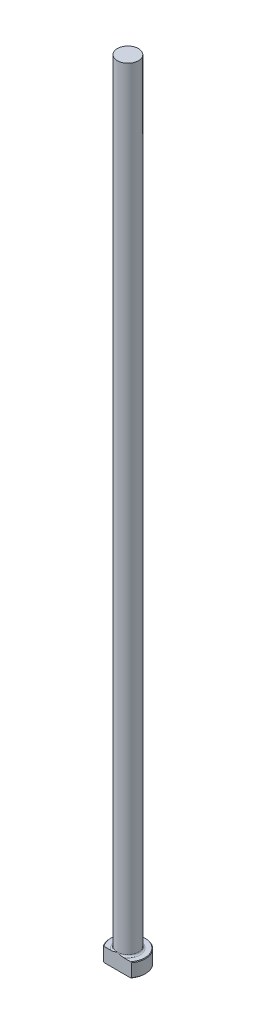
ISO-10303-21;
HEADER;
FILE_DESCRIPTION(('STEP AP214'),'2;1');
FILE_NAME('part.step','',(''),(''),'','','');
FILE_SCHEMA(('AUTOMOTIVE_DESIGN { 1 0 10303 214 1 1 1 1 }'));
ENDSEC;
DATA;
#1=APPLICATION_CONTEXT('core data for automotive mechanical design processes');
#2=APPLICATION_PROTOCOL_DEFINITION('international standard','automotive_design',2000,#1);
#3=PRODUCT_CONTEXT('',#1,'mechanical');
#4=PRODUCT('Part','Part','',(#3));
#5=PRODUCT_RELATED_PRODUCT_CATEGORY('part','',(#4));
#6=PRODUCT_DEFINITION_FORMATION('','',#4);
#7=PRODUCT_DEFINITION_CONTEXT('part definition',#1,'design');
#8=PRODUCT_DEFINITION('design','',#6,#7);
#9=PRODUCT_DEFINITION_SHAPE('','',#8);
#10=(LENGTH_UNIT() NAMED_UNIT(*) SI_UNIT(.MILLI.,.METRE.));
#11=(NAMED_UNIT(*) PLANE_ANGLE_UNIT() SI_UNIT($,.RADIAN.));
#12=(NAMED_UNIT(*) SI_UNIT($,.STERADIAN.) SOLID_ANGLE_UNIT());
#13=UNCERTAINTY_MEASURE_WITH_UNIT(LENGTH_MEASURE(1.E-05),#10,'distance_accuracy_value','');
#14=(GEOMETRIC_REPRESENTATION_CONTEXT(3) GLOBAL_UNCERTAINTY_ASSIGNED_CONTEXT((#13)) GLOBAL_UNIT_ASSIGNED_CONTEXT((#10,
#11,#12)) REPRESENTATION_CONTEXT('',''));
#15=CARTESIAN_POINT('',(0.,0.,0.));
#16=DIRECTION('',(0.,0.,1.));
#17=DIRECTION('',(1.,0.,0.));
#18=AXIS2_PLACEMENT_3D('',#15,#16,#17);
#19=CARTESIAN_POINT('',(0.,0.,0.));
#20=DIRECTION('',(0.,-1.,0.));
#21=DIRECTION('',(0.,0.,-1.));
#22=AXIS2_PLACEMENT_3D('',#19,#20,#21);
#23=PLANE('',#22);
#24=CARTESIAN_POINT('',(0.,0.,0.));
#25=DIRECTION('',(0.,-1.,0.));
#26=DIRECTION('',(0.,0.,-1.));
#27=AXIS2_PLACEMENT_3D('',#24,#25,#26);
#28=CIRCLE('',#27,7.68349999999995);
#29=CARTESIAN_POINT('',(-6.02949135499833,0.,4.76249999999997));
#30=VERTEX_POINT('',#29);
#31=CARTESIAN_POINT('',(6.02949135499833,0.,4.76249999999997));
#32=VERTEX_POINT('',#31);
#33=EDGE_CURVE('E98',#30,#32,#28,.T.);
#34=ORIENTED_EDGE('',*,*,#33,.T.);
#35=DIRECTION('',(-1.,0.,0.));
#36=VECTOR('',#35,1.);
#37=CARTESIAN_POINT('',(-6.34999999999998,0.,4.76249999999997));
#38=LINE('',#37,#36);
#39=EDGE_CURVE('E83',#32,#30,#38,.T.);
#40=ORIENTED_EDGE('',*,*,#39,.T.);
#41=EDGE_LOOP('',(#34,#40));
#42=FACE_BOUND('',#41,.T.);
#43=ADVANCED_FACE('F32',(#42),#23,.T.);
#44=CARTESIAN_POINT('',(0.,259.958771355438,0.));
#45=DIRECTION('',(0.,1.,0.));
#46=DIRECTION('',(0.,0.,1.));
#47=AXIS2_PLACEMENT_3D('',#44,#45,#46);
#48=CYLINDRICAL_SURFACE('',#47,7.93749999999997);
#49=CARTESIAN_POINT('',(0.,6.09599999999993,0.));
#50=DIRECTION('',(0.,1.,0.));
#51=DIRECTION('',(0.,0.,1.));
#52=AXIS2_PLACEMENT_3D('',#49,#50,#51);
#53=CIRCLE('',#52,7.93749999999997);
#54=CARTESIAN_POINT('',(-6.34999999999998,6.09599999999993,4.76249999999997));
#55=VERTEX_POINT('',#54);
#56=CARTESIAN_POINT('',(6.34999999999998,6.09599999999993,4.76249999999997));
#57=VERTEX_POINT('',#56);
#58=EDGE_CURVE('E104',#55,#57,#53,.F.);
#59=ORIENTED_EDGE('',*,*,#58,.T.);
#60=DIRECTION('',(0.,-1.,0.));
#61=VECTOR('',#60,1.);
#62=CARTESIAN_POINT('',(6.34999999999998,355.6,4.76249999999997));
#63=LINE('',#62,#61);
#64=CARTESIAN_POINT('',(6.34999999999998,0.254000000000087,4.76249999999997));
#65=VERTEX_POINT('',#64);
#66=EDGE_CURVE('E183',#57,#65,#63,.T.);
#67=ORIENTED_EDGE('',*,*,#66,.T.);
#68=CARTESIAN_POINT('',(0.,0.254000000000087,0.));
#69=DIRECTION('',(0.,-1.,0.));
#70=DIRECTION('',(0.,0.,-1.));
#71=AXIS2_PLACEMENT_3D('',#68,#69,#70);
#72=CIRCLE('',#71,7.93749999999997);
#73=CARTESIAN_POINT('',(-6.34999999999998,0.254000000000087,4.76249999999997));
#74=VERTEX_POINT('',#73);
#75=EDGE_CURVE('E100',#65,#74,#72,.F.);
#76=ORIENTED_EDGE('',*,*,#75,.T.);
#77=DIRECTION('',(0.,-1.,0.));
#78=VECTOR('',#77,1.);
#79=CARTESIAN_POINT('',(-6.34999999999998,355.6,4.76249999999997));
#80=LINE('',#79,#78);
#81=EDGE_CURVE('E93',#55,#74,#80,.T.);
#82=ORIENTED_EDGE('',*,*,#81,.F.);
#83=EDGE_LOOP('',(#59,#67,#76,#82));
#84=FACE_BOUND('',#83,.T.);
#85=ADVANCED_FACE('F158',(#84),#48,.T.);
#86=CARTESIAN_POINT('',(-7.93749999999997,6.35,0.));
#87=DIRECTION('',(0.,1.,0.));
#88=DIRECTION('',(0.,0.,1.));
#89=AXIS2_PLACEMENT_3D('',#86,#87,#88);
#90=PLANE('',#89);
#91=CARTESIAN_POINT('',(0.,6.35,0.));
#92=DIRECTION('',(0.,1.,0.));
#93=DIRECTION('',(0.,0.,1.));
#94=AXIS2_PLACEMENT_3D('',#91,#92,#93);
#95=CIRCLE('',#94,7.68349999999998);
#96=CARTESIAN_POINT('',(6.02949135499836,6.35,4.76249999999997));
#97=VERTEX_POINT('',#96);
#98=CARTESIAN_POINT('',(-6.02949135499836,6.35,4.76249999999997));
#99=VERTEX_POINT('',#98);
#100=EDGE_CURVE('E178',#97,#99,#95,.T.);
#101=ORIENTED_EDGE('',*,*,#100,.T.);
#102=DIRECTION('',(1.,0.,0.));
#103=VECTOR('',#102,1.);
#104=CARTESIAN_POINT('',(-7.93749999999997,6.35,4.76249999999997));
#105=LINE('',#104,#103);
#106=CARTESIAN_POINT('',(-2.79976677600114,6.35000000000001,4.76249999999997));
#107=VERTEX_POINT('',#106);
#108=EDGE_CURVE('E57',#99,#107,#105,.T.);
#109=ORIENTED_EDGE('',*,*,#108,.T.);
#110=CARTESIAN_POINT('',(0.,6.35,0.));
#111=DIRECTION('',(0.,1.,0.));
#112=DIRECTION('',(0.,0.,1.));
#113=AXIS2_PLACEMENT_3D('',#110,#111,#112);
#114=CIRCLE('',#113,5.52449999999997);
#115=CARTESIAN_POINT('',(2.79976677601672,6.35000000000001,4.76249999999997));
#116=VERTEX_POINT('',#115);
#117=EDGE_CURVE('E107',#107,#116,#114,.F.);
#118=ORIENTED_EDGE('',*,*,#117,.T.);
#119=EDGE_CURVE('E136',#116,#97,#105,.T.);
#120=ORIENTED_EDGE('',*,*,#119,.T.);
#121=EDGE_LOOP('',(#101,#109,#118,#120));
#122=FACE_BOUND('',#121,.T.);
#123=ADVANCED_FACE('F147',(#122),#90,.T.);
#124=CARTESIAN_POINT('',(0.,6.35000000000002,0.));
#125=DIRECTION('',(0.,-1.,0.));
#126=DIRECTION('',(0.,0.,-1.));
#127=AXIS2_PLACEMENT_3D('',#124,#125,#126);
#128=CONICAL_SURFACE('',#127,7.68349999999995,0.785398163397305);
#129=ORIENTED_EDGE('',*,*,#58,.F.);
#130=CARTESIAN_POINT('',(-13.9717238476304,-0.727613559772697,4.76249999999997));
#131=CARTESIAN_POINT('',(-13.7440124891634,-0.512084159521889,4.76249999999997));
#132=CARTESIAN_POINT('',(-13.5160318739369,-0.29683895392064,4.76249999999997));
#133=CARTESIAN_POINT('',(-13.0594385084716,0.13298258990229,4.76249999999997));
#134=CARTESIAN_POINT('',(-12.8308257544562,0.347558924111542,4.76249999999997));
#135=CARTESIAN_POINT('',(-12.1433698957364,0.99062866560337,4.76249999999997));
#136=CARTESIAN_POINT('',(-11.6834388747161,1.41796058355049,4.76249999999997));
#137=CARTESIAN_POINT('',(-10.7398192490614,2.28660831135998,4.76249999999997));
#138=CARTESIAN_POINT('',(-10.2559580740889,2.72773732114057,4.76249999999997));
#139=CARTESIAN_POINT('',(-9.52579613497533,3.38404130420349,4.76249999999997));
#140=CARTESIAN_POINT('',(-9.28181372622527,3.60179461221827,4.76249999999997));
#141=CARTESIAN_POINT('',(-8.7919558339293,4.03515959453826,4.76249999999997));
#142=CARTESIAN_POINT('',(-8.54608036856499,4.25077128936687,4.76249999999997));
#143=CARTESIAN_POINT('',(-8.0523506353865,4.67899963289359,4.76249999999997));
#144=CARTESIAN_POINT('',(-7.80449972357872,4.89162014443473,4.76249999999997));
#145=CARTESIAN_POINT('',(-7.30587283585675,5.3134375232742,4.76249999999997));
#146=CARTESIAN_POINT('',(-7.05509670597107,5.52263420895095,4.76249999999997));
#147=CARTESIAN_POINT('',(-6.54895570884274,5.93726289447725,4.76249999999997));
#148=CARTESIAN_POINT('',(-6.29357776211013,6.14267898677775,4.76249999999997));
#149=CARTESIAN_POINT('',(-5.77806261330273,6.54738613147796,4.76249999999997));
#150=CARTESIAN_POINT('',(-5.5179261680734,6.74667814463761,4.76249999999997));
#151=CARTESIAN_POINT('',(-4.99669315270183,7.13290361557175,4.76249999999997));
#152=CARTESIAN_POINT('',(-4.73572280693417,7.32000565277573,4.76249999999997));
#153=CARTESIAN_POINT('',(-4.33820944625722,7.59205599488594,4.76249999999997));
#154=CARTESIAN_POINT('',(-4.20463607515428,7.68134253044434,4.76249999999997));
#155=CARTESIAN_POINT('',(-3.93520014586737,7.85638938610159,4.76249999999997));
#156=CARTESIAN_POINT('',(-3.79933771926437,7.9421499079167,4.76249999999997));
#157=CARTESIAN_POINT('',(-3.52582078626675,8.10887856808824,4.76249999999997));
#158=CARTESIAN_POINT('',(-3.38818211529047,8.18987258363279,4.76249999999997));
#159=CARTESIAN_POINT('',(-3.10994368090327,8.34667799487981,4.76249999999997));
#160=CARTESIAN_POINT('',(-2.96934354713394,8.42248873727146,4.76249999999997));
#161=CARTESIAN_POINT('',(-2.68509318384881,8.56758570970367,4.76249999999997));
#162=CARTESIAN_POINT('',(-2.5414484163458,8.63688258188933,4.76249999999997));
#163=CARTESIAN_POINT('',(-2.25062082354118,8.76758710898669,4.76249999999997));
#164=CARTESIAN_POINT('',(-2.10343915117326,8.82899729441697,4.76249999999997));
#165=CARTESIAN_POINT('',(-1.88433335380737,8.91218004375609,4.76249999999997));
#166=CARTESIAN_POINT('',(-1.81383186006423,8.9377212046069,4.76249999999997));
#167=CARTESIAN_POINT('',(-1.67202052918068,8.98645907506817,4.76249999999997));
#168=CARTESIAN_POINT('',(-1.6007106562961,9.00965568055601,4.76249999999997));
#169=CARTESIAN_POINT('',(-1.38555472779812,9.0754228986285,4.76249999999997));
#170=CARTESIAN_POINT('',(-1.24050522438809,9.11416209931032,4.76249999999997));
#171=CARTESIAN_POINT('',(-0.948515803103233,9.1795356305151,4.76249999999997));
#172=CARTESIAN_POINT('',(-0.801590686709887,9.20623542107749,4.76249999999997));
#173=CARTESIAN_POINT('',(-0.50593058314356,9.24644001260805,4.76249999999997));
#174=CARTESIAN_POINT('',(-0.357195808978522,9.25994635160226,4.76249999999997));
#175=CARTESIAN_POINT('',(-0.0580773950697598,9.2730054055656,4.76249999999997));
#176=CARTESIAN_POINT('',(0.0923105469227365,9.27246142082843,4.76249999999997));
#177=CARTESIAN_POINT('',(0.392354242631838,9.25721584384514,4.76249999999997));
#178=CARTESIAN_POINT('',(0.5420099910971,9.24251415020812,4.76249999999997));
#179=CARTESIAN_POINT('',(0.840076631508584,9.19973713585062,4.76249999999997));
#180=CARTESIAN_POINT('',(0.988478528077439,9.17160009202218,4.76249999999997));
#181=CARTESIAN_POINT('',(1.28250292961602,9.10341431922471,4.76249999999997));
#182=CARTESIAN_POINT('',(1.42812484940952,9.0633631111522,4.76249999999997));
#183=CARTESIAN_POINT('',(1.8015765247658,8.946301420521,4.76249999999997));
#184=CARTESIAN_POINT('',(2.02694427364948,8.86145845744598,4.76249999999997));
#185=CARTESIAN_POINT('',(2.46947102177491,8.67257542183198,4.76249999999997));
#186=CARTESIAN_POINT('',(2.6866230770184,8.56851952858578,4.76249999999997));
#187=CARTESIAN_POINT('',(3.00782565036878,8.40144847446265,4.76249999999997));
#188=CARTESIAN_POINT('',(3.11463323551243,8.34362692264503,4.76249999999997));
#189=CARTESIAN_POINT('',(3.32653927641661,8.22492412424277,4.76249999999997));
#190=CARTESIAN_POINT('',(3.43163771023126,8.16404283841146,4.76249999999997));
#191=CARTESIAN_POINT('',(3.64022442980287,8.03970047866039,4.76249999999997));
#192=CARTESIAN_POINT('',(3.74371344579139,7.97624062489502,4.76249999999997));
#193=CARTESIAN_POINT('',(3.94927417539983,7.84708004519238,4.76249999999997));
#194=CARTESIAN_POINT('',(4.05134594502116,7.78137940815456,4.76249999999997));
#195=CARTESIAN_POINT('',(4.39010681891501,7.55875403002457,4.76249999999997));
#196=CARTESIAN_POINT('',(4.62396840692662,7.39752115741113,4.76249999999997));
#197=CARTESIAN_POINT('',(5.08629215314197,7.06746483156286,4.76249999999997));
#198=CARTESIAN_POINT('',(5.31475310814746,6.89863971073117,4.76249999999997));
#199=CARTESIAN_POINT('',(5.76756292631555,6.55523763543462,4.76249999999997));
#200=CARTESIAN_POINT('',(5.99190862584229,6.38065652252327,4.76249999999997));
#201=CARTESIAN_POINT('',(6.43717517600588,6.02723273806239,4.76249999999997));
#202=CARTESIAN_POINT('',(6.65809630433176,5.84839041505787,4.76249999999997));
#203=CARTESIAN_POINT('',(7.09790647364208,5.48680641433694,4.76249999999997));
#204=CARTESIAN_POINT('',(7.31678672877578,5.30405407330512,4.76249999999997));
#205=CARTESIAN_POINT('',(7.75231370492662,4.93590430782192,4.76249999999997));
#206=CARTESIAN_POINT('',(7.9689603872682,4.75050683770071,4.76249999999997));
#207=CARTESIAN_POINT('',(8.4003252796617,4.37766695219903,4.76249999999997));
#208=CARTESIAN_POINT('',(8.6150442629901,4.19022543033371,4.76249999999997));
#209=CARTESIAN_POINT('',(9.04295707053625,3.81360841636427,4.76249999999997));
#210=CARTESIAN_POINT('',(9.25615088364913,3.62443291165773,4.76249999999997));
#211=CARTESIAN_POINT('',(9.85099823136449,3.09302727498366,4.76249999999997));
#212=CARTESIAN_POINT('',(10.2312296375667,2.74920552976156,4.76249999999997));
#213=CARTESIAN_POINT('',(10.9886755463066,2.05817278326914,4.76249999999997));
#214=CARTESIAN_POINT('',(11.3658896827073,1.71096138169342,4.76249999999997));
#215=CARTESIAN_POINT('',(12.1155837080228,1.01624347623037,4.76249999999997));
#216=CARTESIAN_POINT('',(12.4880784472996,0.668752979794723,4.76249999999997));
#217=CARTESIAN_POINT('',(13.2311819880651,-0.0281268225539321,4.76249999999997));
#218=CARTESIAN_POINT('',(13.601791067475,-0.377515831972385,4.76249999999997));
#219=CARTESIAN_POINT('',(13.9717238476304,-0.727613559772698,4.76249999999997));
#220=B_SPLINE_CURVE_WITH_KNOTS('',3,(#130,#131,#132,#133,#134,#135,#136,#137,#138,#139,#140,
#141,#142,#143,#144,#145,#146,#147,#148,#149,#150,#151,#152,#153,#154,#155,#156,#157,#158,#159,
#160,#161,#162,#163,#164,#165,#166,#167,#168,#169,#170,#171,#172,#173,#174,#175,#176,#177,#178,
#179,#180,#181,#182,#183,#184,#185,#186,#187,#188,#189,#190,#191,#192,#193,#194,#195,#196,#197,
#198,#199,#200,#201,#202,#203,#204,#205,#206,#207,#208,#209,#210,#211,#212,#213,#214,#215,#216,
#217,#218,#219),.UNSPECIFIED.,.F.,.F.,(4,2,2,2,2,2,2,2,2,2,2,2,2,2,2,2,2,2,2,2,2,2,2,2,2,2,2,2,
2,2,2,2,2,2,2,2,2,2,2,2,2,2,2,2,4),(0.,0.940610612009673,1.88122685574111,3.76464908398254,
5.72889030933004,6.7099492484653,7.69099877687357,8.67063680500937,9.650326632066,
10.6334769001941,11.6164721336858,12.5795523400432,13.0615108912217,13.543441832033,
14.022454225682,14.5015268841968,14.9798027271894,15.457924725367,15.682844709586,
15.9077746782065,16.3577079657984,16.8051644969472,17.2525688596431,17.7030532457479,
18.1535408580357,18.606118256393,19.0587898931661,19.7799130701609,20.5016327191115,
20.86595589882,21.2302837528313,21.5944411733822,21.958584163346,22.8105074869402,
23.6626188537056,24.515359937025,25.3680315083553,26.2234368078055,27.0788568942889,
27.9339169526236,28.7889832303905,30.3268416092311,31.8648838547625,33.393116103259,
34.9211161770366),.UNSPECIFIED.);
#221=EDGE_CURVE('E135',#55,#99,#220,.T.);
#222=ORIENTED_EDGE('',*,*,#221,.T.);
#223=ORIENTED_EDGE('',*,*,#100,.F.);
#224=EDGE_CURVE('E127',#97,#57,#220,.T.);
#225=ORIENTED_EDGE('',*,*,#224,.T.);
#226=EDGE_LOOP('',(#129,#222,#223,#225));
#227=FACE_BOUND('',#226,.T.);
#228=ADVANCED_FACE('F143',(#227),#128,.T.);
#229=CARTESIAN_POINT('',(0.,0.254000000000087,0.));
#230=DIRECTION('',(0.,1.,0.));
#231=DIRECTION('',(0.,0.,1.));
#232=AXIS2_PLACEMENT_3D('',#229,#230,#231);
#233=CONICAL_SURFACE('',#232,7.93749999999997,0.785398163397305);
#234=ORIENTED_EDGE('',*,*,#75,.F.);
#235=CARTESIAN_POINT('',(13.9717238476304,7.07761355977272,4.76249999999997));
#236=CARTESIAN_POINT('',(13.7440124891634,6.86208415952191,4.76249999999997));
#237=CARTESIAN_POINT('',(13.5160318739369,6.64683895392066,4.76249999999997));
#238=CARTESIAN_POINT('',(13.0594385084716,6.21701741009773,4.76249999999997));
#239=CARTESIAN_POINT('',(12.8308257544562,6.00244107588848,4.76249999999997));
#240=CARTESIAN_POINT('',(12.1433698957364,5.35937133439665,4.76249999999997));
#241=CARTESIAN_POINT('',(11.6834388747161,4.93203941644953,4.76249999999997));
#242=CARTESIAN_POINT('',(10.7398192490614,4.06339168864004,4.76249999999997));
#243=CARTESIAN_POINT('',(10.2559580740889,3.62226267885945,4.76249999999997));
#244=CARTESIAN_POINT('',(9.52579613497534,2.96595869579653,4.76249999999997));
#245=CARTESIAN_POINT('',(9.28181372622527,2.74820538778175,4.76249999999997));
#246=CARTESIAN_POINT('',(8.7919558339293,2.31484040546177,4.76249999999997));
#247=CARTESIAN_POINT('',(8.546080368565,2.09922871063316,4.76249999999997));
#248=CARTESIAN_POINT('',(8.0523506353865,1.67100036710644,4.76249999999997));
#249=CARTESIAN_POINT('',(7.80449972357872,1.4583798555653,4.76249999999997));
#250=CARTESIAN_POINT('',(7.30587283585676,1.03656247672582,4.76249999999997));
#251=CARTESIAN_POINT('',(7.05509670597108,0.827365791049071,4.76249999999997));
#252=CARTESIAN_POINT('',(6.54895570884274,0.412737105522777,4.76249999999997));
#253=CARTESIAN_POINT('',(6.29357776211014,0.207321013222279,4.76249999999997));
#254=CARTESIAN_POINT('',(5.77806261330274,-0.197386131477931,4.76249999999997));
#255=CARTESIAN_POINT('',(5.5179261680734,-0.396678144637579,4.76249999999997));
#256=CARTESIAN_POINT('',(4.99669315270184,-0.782903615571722,4.76249999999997));
#257=CARTESIAN_POINT('',(4.73572280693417,-0.970005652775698,4.76249999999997));
#258=CARTESIAN_POINT('',(4.33820944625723,-1.24205599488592,4.76249999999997));
#259=CARTESIAN_POINT('',(4.20463607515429,-1.33134253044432,4.76249999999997));
#260=CARTESIAN_POINT('',(3.93520014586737,-1.50638938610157,4.76249999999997));
#261=CARTESIAN_POINT('',(3.79933771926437,-1.59214990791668,4.76249999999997));
#262=CARTESIAN_POINT('',(3.52582078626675,-1.75887856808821,4.76249999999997));
#263=CARTESIAN_POINT('',(3.38818211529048,-1.83987258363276,4.76249999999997));
#264=CARTESIAN_POINT('',(3.10994368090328,-1.99667799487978,4.76249999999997));
#265=CARTESIAN_POINT('',(2.96934354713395,-2.07248873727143,4.76249999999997));
#266=CARTESIAN_POINT('',(2.68509318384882,-2.21758570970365,4.76249999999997));
#267=CARTESIAN_POINT('',(2.54144841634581,-2.2868825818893,4.76249999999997));
#268=CARTESIAN_POINT('',(2.25062082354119,-2.41758710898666,4.76249999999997));
#269=CARTESIAN_POINT('',(2.10343915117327,-2.47899729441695,4.76249999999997));
#270=CARTESIAN_POINT('',(1.88433335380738,-2.56218004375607,4.76249999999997));
#271=CARTESIAN_POINT('',(1.81383186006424,-2.58772120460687,4.76249999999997));
#272=CARTESIAN_POINT('',(1.67202052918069,-2.63645907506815,4.76249999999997));
#273=CARTESIAN_POINT('',(1.60071065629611,-2.65965568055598,4.76249999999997));
#274=CARTESIAN_POINT('',(1.38555472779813,-2.72542289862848,4.76249999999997));
#275=CARTESIAN_POINT('',(1.2405052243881,-2.7641620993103,4.76249999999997));
#276=CARTESIAN_POINT('',(0.948515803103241,-2.82953563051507,4.76249999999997));
#277=CARTESIAN_POINT('',(0.801590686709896,-2.85623542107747,4.76249999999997));
#278=CARTESIAN_POINT('',(0.505930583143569,-2.89644001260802,4.76249999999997));
#279=CARTESIAN_POINT('',(0.357195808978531,-2.90994635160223,4.76249999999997));
#280=CARTESIAN_POINT('',(0.0580773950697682,-2.92300540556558,4.76249999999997));
#281=CARTESIAN_POINT('',(-0.0923105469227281,-2.92246142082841,4.76249999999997));
#282=CARTESIAN_POINT('',(-0.392354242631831,-2.90721584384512,4.76249999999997));
#283=CARTESIAN_POINT('',(-0.542009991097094,-2.8925141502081,4.76249999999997));
#284=CARTESIAN_POINT('',(-0.840076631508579,-2.84973713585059,4.76249999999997));
#285=CARTESIAN_POINT('',(-0.988478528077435,-2.82160009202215,4.76249999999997));
#286=CARTESIAN_POINT('',(-1.28250292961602,-2.75341431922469,4.76249999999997));
#287=CARTESIAN_POINT('',(-1.42812484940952,-2.71336311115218,4.76249999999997));
#288=CARTESIAN_POINT('',(-1.80157652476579,-2.59630142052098,4.76249999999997));
#289=CARTESIAN_POINT('',(-2.02694427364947,-2.51145845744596,4.76249999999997));
#290=CARTESIAN_POINT('',(-2.4694710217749,-2.32257542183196,4.76249999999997));
#291=CARTESIAN_POINT('',(-2.68662307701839,-2.21851952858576,4.76249999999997));
#292=CARTESIAN_POINT('',(-3.00782565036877,-2.05144847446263,4.76249999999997));
#293=CARTESIAN_POINT('',(-3.11463323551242,-1.99362692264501,4.76249999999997));
#294=CARTESIAN_POINT('',(-3.3265392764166,-1.87492412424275,4.76249999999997));
#295=CARTESIAN_POINT('',(-3.43163771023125,-1.81404283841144,4.76249999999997));
#296=CARTESIAN_POINT('',(-3.64022442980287,-1.68970047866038,4.76249999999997));
#297=CARTESIAN_POINT('',(-3.74371344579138,-1.626240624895,4.76249999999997));
#298=CARTESIAN_POINT('',(-3.94927417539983,-1.49708004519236,4.76249999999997));
#299=CARTESIAN_POINT('',(-4.05134594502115,-1.43137940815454,4.76249999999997));
#300=CARTESIAN_POINT('',(-4.390106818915,-1.20875403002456,4.76249999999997));
#301=CARTESIAN_POINT('',(-4.62396840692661,-1.04752115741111,4.76249999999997));
#302=CARTESIAN_POINT('',(-5.08629215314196,-0.71746483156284,4.76249999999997));
#303=CARTESIAN_POINT('',(-5.31475310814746,-0.548639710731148,4.76249999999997));
#304=CARTESIAN_POINT('',(-5.76756292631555,-0.205237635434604,4.76249999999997));
#305=CARTESIAN_POINT('',(-5.99190862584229,-0.0306565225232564,4.76249999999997));
#306=CARTESIAN_POINT('',(-6.43717517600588,0.322767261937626,4.76249999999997));
#307=CARTESIAN_POINT('',(-6.65809630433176,0.501609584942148,4.76249999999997));
#308=CARTESIAN_POINT('',(-7.09790647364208,0.863193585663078,4.76249999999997));
#309=CARTESIAN_POINT('',(-7.31678672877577,1.0459459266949,4.76249999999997));
#310=CARTESIAN_POINT('',(-7.75231370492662,1.4140956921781,4.76249999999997));
#311=CARTESIAN_POINT('',(-7.96896038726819,1.59949316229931,4.76249999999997));
#312=CARTESIAN_POINT('',(-8.4003252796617,1.97233304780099,4.76249999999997));
#313=CARTESIAN_POINT('',(-8.61504426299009,2.15977456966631,4.76249999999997));
#314=CARTESIAN_POINT('',(-9.04295707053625,2.53639158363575,4.76249999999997));
#315=CARTESIAN_POINT('',(-9.25615088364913,2.72556708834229,4.76249999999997));
#316=CARTESIAN_POINT('',(-9.85099823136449,3.25697272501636,4.76249999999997));
#317=CARTESIAN_POINT('',(-10.2312296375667,3.60079447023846,4.76249999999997));
#318=CARTESIAN_POINT('',(-10.9886755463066,4.29182721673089,4.76249999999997));
#319=CARTESIAN_POINT('',(-11.3658896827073,4.63903861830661,4.76249999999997));
#320=CARTESIAN_POINT('',(-12.1155837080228,5.33375652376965,4.76249999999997));
#321=CARTESIAN_POINT('',(-12.4880784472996,5.6812470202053,4.76249999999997));
#322=CARTESIAN_POINT('',(-13.2311819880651,6.37812682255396,4.76249999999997));
#323=CARTESIAN_POINT('',(-13.601791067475,6.72751583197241,4.76249999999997));
#324=CARTESIAN_POINT('',(-13.9717238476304,7.07761355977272,4.76249999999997));
#325=B_SPLINE_CURVE_WITH_KNOTS('',3,(#235,#236,#237,#238,#239,#240,#241,#242,#243,#244,#245,
#246,#247,#248,#249,#250,#251,#252,#253,#254,#255,#256,#257,#258,#259,#260,#261,#262,#263,#264,
#265,#266,#267,#268,#269,#270,#271,#272,#273,#274,#275,#276,#277,#278,#279,#280,#281,#282,#283,
#284,#285,#286,#287,#288,#289,#290,#291,#292,#293,#294,#295,#296,#297,#298,#299,#300,#301,#302,
#303,#304,#305,#306,#307,#308,#309,#310,#311,#312,#313,#314,#315,#316,#317,#318,#319,#320,#321,
#322,#323,#324),.UNSPECIFIED.,.F.,.F.,(4,2,2,2,2,2,2,2,2,2,2,2,2,2,2,2,2,2,2,2,2,2,2,2,2,2,2,2,
2,2,2,2,2,2,2,2,2,2,2,2,2,2,2,2,4),(0.,0.940610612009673,1.88122685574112,3.76464908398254,
5.72889030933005,6.7099492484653,7.69099877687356,8.67063680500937,9.650326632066,
10.6334769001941,11.6164721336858,12.5795523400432,13.0615108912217,13.543441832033,
14.022454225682,14.5015268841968,14.9798027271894,15.4579247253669,15.682844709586,
15.9077746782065,16.3577079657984,16.8051644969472,17.2525688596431,17.7030532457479,
18.1535408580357,18.606118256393,19.0587898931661,19.7799130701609,20.5016327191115,
20.86595589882,21.2302837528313,21.5944411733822,21.958584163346,22.8105074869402,
23.6626188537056,24.515359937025,25.3680315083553,26.2234368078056,27.0788568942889,
27.9339169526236,28.7889832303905,30.3268416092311,31.8648838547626,33.393116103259,
34.9211161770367),.UNSPECIFIED.);
#326=EDGE_CURVE('E86',#65,#32,#325,.T.);
#327=ORIENTED_EDGE('',*,*,#326,.T.);
#328=ORIENTED_EDGE('',*,*,#33,.F.);
#329=EDGE_CURVE('E89',#30,#74,#325,.T.);
#330=ORIENTED_EDGE('',*,*,#329,.T.);
#331=EDGE_LOOP('',(#234,#327,#328,#330));
#332=FACE_BOUND('',#331,.T.);
#333=ADVANCED_FACE('F97',(#332),#233,.T.);
#334=CARTESIAN_POINT('',(0.,7.11200000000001,0.));
#335=DIRECTION('',(0.,1.,0.));
#336=DIRECTION('',(0.,0.,1.));
#337=AXIS2_PLACEMENT_3D('',#334,#335,#336);
#338=TOROIDAL_SURFACE('',#337,5.52449999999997,0.762);
#339=CARTESIAN_POINT('',(0.,7.11200000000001,4.76249999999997));
#340=CARTESIAN_POINT('',(1.7571576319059E-10,7.11200099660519,4.76249999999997));
#341=CARTESIAN_POINT('',(2.11716127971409E-07,7.11200199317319,4.76249999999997));
#342=CARTESIAN_POINT('',(8.80753956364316E-07,7.1120039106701,4.76249999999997));
#343=CARTESIAN_POINT('',(1.34491796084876E-06,7.11200482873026,4.76249999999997));
#344=CARTESIAN_POINT('',(2.45982947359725E-06,7.11200666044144,4.76249999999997));
#345=CARTESIAN_POINT('',(3.12384157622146E-06,7.11200756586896,4.76249999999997));
#346=CARTESIAN_POINT('',(4.5550794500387E-06,7.11200927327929,4.76249999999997));
#347=CARTESIAN_POINT('',(5.32136303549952E-06,7.11201007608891,4.76249999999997));
#348=CARTESIAN_POINT('',(8.07192927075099E-06,7.11201277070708,4.76249999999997));
#349=CARTESIAN_POINT('',(1.01901643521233E-05,7.11201452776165,4.76249999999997));
#350=CARTESIAN_POINT('',(1.4565159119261E-05,7.11201765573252,4.76249999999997));
#351=CARTESIAN_POINT('',(1.68139275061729E-05,7.11201903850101,4.76249999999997));
#352=CARTESIAN_POINT('',(2.56002968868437E-05,7.1120242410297,4.76249999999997));
#353=CARTESIAN_POINT('',(3.23057719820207E-05,7.11202779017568,4.76249999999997));
#354=CARTESIAN_POINT('',(4.55210144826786E-05,7.11203358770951,4.76249999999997));
#355=CARTESIAN_POINT('',(5.19929180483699E-05,7.1120359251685,4.76249999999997));
#356=CARTESIAN_POINT('',(7.95921607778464E-05,7.11204586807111,4.76249999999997));
#357=CARTESIAN_POINT('',(0.000100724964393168,7.11205341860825,4.76249999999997));
#358=CARTESIAN_POINT('',(0.00014026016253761,7.11206552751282,4.76249999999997));
#359=CARTESIAN_POINT('',(0.000158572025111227,7.11207036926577,4.76249999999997));
#360=CARTESIAN_POINT('',(0.000291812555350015,7.11210874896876,4.76249999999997));
#361=CARTESIAN_POINT('',(0.000401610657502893,7.11215771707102,4.76249999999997));
#362=CARTESIAN_POINT('',(0.0008287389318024,7.1123412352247,4.76249999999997));
#363=CARTESIAN_POINT('',(0.00114963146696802,7.11246431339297,4.76249999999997));
#364=CARTESIAN_POINT('',(0.00239628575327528,7.11294956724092,4.76249999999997));
#365=CARTESIAN_POINT('',(0.00331839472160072,7.11332376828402,4.76249999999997));
#366=CARTESIAN_POINT('',(0.00709602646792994,7.11484953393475,4.76249999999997));
#367=CARTESIAN_POINT('',(0.00995556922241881,7.11598757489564,4.76249999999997));
#368=CARTESIAN_POINT('',(0.0776380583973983,7.14293320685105,4.76249999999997));
#369=CARTESIAN_POINT('',(0.142407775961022,7.16892226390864,4.76249999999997));
#370=CARTESIAN_POINT('',(0.269647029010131,7.2196189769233,4.76249999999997));
#371=CARTESIAN_POINT('',(0.332112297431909,7.24433828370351,4.76249999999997));
#372=CARTESIAN_POINT('',(0.464537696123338,7.29630170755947,4.76249999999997));
#373=CARTESIAN_POINT('',(0.534515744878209,7.32350106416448,4.76249999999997));
#374=CARTESIAN_POINT('',(0.67548014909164,7.3774238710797,4.76249999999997));
#375=CARTESIAN_POINT('',(0.746469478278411,7.40413956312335,4.76249999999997));
#376=CARTESIAN_POINT('',(0.870073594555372,7.44962494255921,4.76249999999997));
#377=CARTESIAN_POINT('',(0.922600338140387,7.46863321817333,4.76249999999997));
#378=CARTESIAN_POINT('',(1.02776923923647,7.50591527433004,4.76249999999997));
#379=CARTESIAN_POINT('',(1.08041080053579,7.52419073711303,4.76249999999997));
#380=CARTESIAN_POINT('',(1.23635883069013,7.5769919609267,4.76249999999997));
#381=CARTESIAN_POINT('',(1.34005657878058,7.61037532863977,4.76249999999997));
#382=CARTESIAN_POINT('',(1.56359060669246,7.67746997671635,4.76249999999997));
#383=CARTESIAN_POINT('',(1.68362015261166,7.71054957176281,4.76249999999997));
#384=CARTESIAN_POINT('',(1.92642555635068,7.76967498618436,4.76249999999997));
#385=CARTESIAN_POINT('',(2.04921557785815,7.79566353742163,4.76249999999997));
#386=CARTESIAN_POINT('',(2.30422797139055,7.83918726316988,4.76249999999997));
#387=CARTESIAN_POINT('',(2.43656426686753,7.85610069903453,4.76249999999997));
#388=CARTESIAN_POINT('',(2.63563546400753,7.8702758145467,4.76249999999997));
#389=CARTESIAN_POINT('',(2.70197039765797,7.87313972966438,4.76249999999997));
#390=CARTESIAN_POINT('',(2.83467605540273,7.87452977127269,4.76249999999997));
#391=CARTESIAN_POINT('',(2.90104677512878,7.87305634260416,4.76249999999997));
#392=CARTESIAN_POINT('',(3.06624711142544,7.86305254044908,4.76249999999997));
#393=CARTESIAN_POINT('',(3.1649502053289,7.85140164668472,4.76249999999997));
#394=CARTESIAN_POINT('',(3.3102514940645,7.82310986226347,4.76249999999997));
#395=CARTESIAN_POINT('',(3.35793795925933,7.81197880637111,4.76249999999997));
#396=CARTESIAN_POINT('',(3.45215770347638,7.78564548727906,4.76249999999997));
#397=CARTESIAN_POINT('',(3.49869187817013,7.77044650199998,4.76249999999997));
#398=CARTESIAN_POINT('',(3.59306902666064,7.73421407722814,4.76249999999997));
#399=CARTESIAN_POINT('',(3.64079022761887,7.71285751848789,4.76249999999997));
#400=CARTESIAN_POINT('',(3.73313951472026,7.66398014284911,4.76249999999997));
#401=CARTESIAN_POINT('',(3.77776331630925,7.63645100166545,4.76249999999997));
#402=CARTESIAN_POINT('',(3.8538778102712,7.58041326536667,4.76249999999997));
#403=CARTESIAN_POINT('',(3.88624519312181,7.55310714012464,4.76249999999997));
#404=CARTESIAN_POINT('',(3.94622799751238,7.49369496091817,4.76249999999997));
#405=CARTESIAN_POINT('',(3.97385320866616,7.46159905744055,4.76249999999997));
#406=CARTESIAN_POINT('',(4.01655184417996,7.4011650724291,4.76249999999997));
#407=CARTESIAN_POINT('',(4.03304226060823,7.37383278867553,4.76249999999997));
#408=CARTESIAN_POINT('',(4.06135260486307,7.31682811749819,4.76249999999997));
#409=CARTESIAN_POINT('',(4.07317539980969,7.28715718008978,4.76249999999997));
#410=CARTESIAN_POINT('',(4.09136459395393,7.22592510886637,4.76249999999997));
#411=CARTESIAN_POINT('',(4.09769076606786,7.19435181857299,4.76249999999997));
#412=CARTESIAN_POINT('',(4.10417375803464,7.13057793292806,4.76249999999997));
#413=CARTESIAN_POINT('',(4.10433369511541,7.0983776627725,4.76249999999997));
#414=CARTESIAN_POINT('',(4.09881588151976,7.03816798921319,4.76249999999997));
#415=CARTESIAN_POINT('',(4.09379438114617,7.01009545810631,4.76249999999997));
#416=CARTESIAN_POINT('',(4.07925766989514,6.95514890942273,4.76249999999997));
#417=CARTESIAN_POINT('',(4.06974176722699,6.92827507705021,4.76249999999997));
#418=CARTESIAN_POINT('',(4.04639465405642,6.87537805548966,4.76249999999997));
#419=CARTESIAN_POINT('',(4.03242569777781,6.84941634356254,4.76249999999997));
#420=CARTESIAN_POINT('',(4.00102190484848,6.79970293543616,4.76249999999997));
#421=CARTESIAN_POINT('',(3.98358563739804,6.77595215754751,4.76249999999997));
#422=CARTESIAN_POINT('',(3.93494606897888,6.71761387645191,4.76249999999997));
#423=CARTESIAN_POINT('',(3.90164076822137,6.68477550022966,4.76249999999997));
#424=CARTESIAN_POINT('',(3.83023707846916,6.62476083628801,4.76249999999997));
#425=CARTESIAN_POINT('',(3.79212391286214,6.59760272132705,4.76249999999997));
#426=CARTESIAN_POINT('',(3.69123876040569,6.53519525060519,4.76249999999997));
#427=CARTESIAN_POINT('',(3.62627547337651,6.5035096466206,4.76249999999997));
#428=CARTESIAN_POINT('',(3.49255240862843,6.45041788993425,4.76249999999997));
#429=CARTESIAN_POINT('',(3.42379589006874,6.42900306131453,4.76249999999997));
#430=CARTESIAN_POINT('',(3.29415895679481,6.39697273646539,4.76249999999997));
#431=CARTESIAN_POINT('',(3.23354049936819,6.38525800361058,4.76249999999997));
#432=CARTESIAN_POINT('',(3.11149484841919,6.36705546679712,4.76249999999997));
#433=CARTESIAN_POINT('',(3.05006701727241,6.36057206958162,4.76249999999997));
#434=CARTESIAN_POINT('',(2.92589148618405,6.35201311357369,4.76249999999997));
#435=CARTESIAN_POINT('',(2.86313887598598,6.35001297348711,4.76249999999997));
#436=CARTESIAN_POINT('',(2.73768820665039,6.34998716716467,4.76249999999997));
#437=CARTESIAN_POINT('',(2.67499013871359,6.35195889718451,4.76249999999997));
#438=CARTESIAN_POINT('',(2.52932457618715,6.3605299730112,4.76249999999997));
#439=CARTESIAN_POINT('',(2.44643477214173,6.36843196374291,4.76249999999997));
#440=CARTESIAN_POINT('',(2.28127175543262,6.38922870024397,4.76249999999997));
#441=CARTESIAN_POINT('',(2.19899884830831,6.40212577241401,4.76249999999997));
#442=CARTESIAN_POINT('',(1.95269348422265,6.44712458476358,4.76249999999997));
#443=CARTESIAN_POINT('',(1.78980549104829,6.48548332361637,4.76249999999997));
#444=CARTESIAN_POINT('',(1.48033682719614,6.56994207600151,4.76249999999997));
#445=CARTESIAN_POINT('',(1.33350347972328,6.615164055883,4.76249999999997));
#446=CARTESIAN_POINT('',(1.04345459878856,6.71161170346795,4.76249999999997));
#447=CARTESIAN_POINT('',(0.900217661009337,6.76277370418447,4.76249999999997));
#448=CARTESIAN_POINT('',(0.704750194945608,6.83559047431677,4.76249999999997));
#449=CARTESIAN_POINT('',(0.651886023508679,6.85558735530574,4.76249999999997));
#450=CARTESIAN_POINT('',(0.544940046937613,6.89652727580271,4.76249999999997));
#451=CARTESIAN_POINT('',(0.49086245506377,6.91748138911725,4.76249999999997));
#452=CARTESIAN_POINT('',(0.399545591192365,6.95317215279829,4.76249999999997));
#453=CARTESIAN_POINT('',(0.362273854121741,6.96782635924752,4.76249999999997));
#454=CARTESIAN_POINT('',(0.288146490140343,6.9971046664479,4.76249999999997));
#455=CARTESIAN_POINT('',(0.251290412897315,7.01172761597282,4.76249999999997));
#456=CARTESIAN_POINT('',(0.181451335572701,7.03949988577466,4.76249999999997));
#457=CARTESIAN_POINT('',(0.14846593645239,7.05264357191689,4.76249999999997));
#458=CARTESIAN_POINT('',(0.0812672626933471,7.07951218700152,4.76249999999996));
#459=CARTESIAN_POINT('',(0.0470550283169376,7.09324020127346,4.76249999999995));
#460=CARTESIAN_POINT('',(0.00995870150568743,7.10801136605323,4.76249999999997));
#461=CARTESIAN_POINT('',(0.00710220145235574,7.10914804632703,4.76249999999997));
#462=CARTESIAN_POINT('',(0.00332530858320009,7.11067346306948,4.76249999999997));
#463=CARTESIAN_POINT('',(0.00240087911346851,7.11104861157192,4.76249999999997));
#464=CARTESIAN_POINT('',(0.0011512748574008,7.11153501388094,4.76249999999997));
#465=CARTESIAN_POINT('',(0.000829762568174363,7.11165833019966,4.76249999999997));
#466=CARTESIAN_POINT('',(0.000401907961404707,7.1118421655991,4.76249999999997));
#467=CARTESIAN_POINT('',(0.000291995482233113,7.11189118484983,4.76249999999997));
#468=CARTESIAN_POINT('',(0.000158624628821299,7.11192959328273,4.76249999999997));
#469=CARTESIAN_POINT('',(0.000140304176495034,7.11193443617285,4.76249999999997));
#470=CARTESIAN_POINT('',(0.000100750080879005,7.11194655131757,4.76249999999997));
#471=CARTESIAN_POINT('',(7.96072020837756E-05,7.11195410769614,4.76249999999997));
#472=CARTESIAN_POINT('',(5.19966524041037E-05,7.11196405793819,4.76249999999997));
#473=CARTESIAN_POINT('',(4.55234098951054E-05,7.11196639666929,4.76249999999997));
#474=CARTESIAN_POINT('',(3.23056445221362E-05,7.11197219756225,4.76249999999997));
#475=CARTESIAN_POINT('',(2.559903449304E-05,7.11197574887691,4.76249999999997));
#476=CARTESIAN_POINT('',(1.68115971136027E-05,7.11198095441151,4.76249999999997));
#477=CARTESIAN_POINT('',(1.45627239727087E-05,7.11198233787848,4.76249999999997));
#478=CARTESIAN_POINT('',(1.01876581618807E-05,7.11198546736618,4.76249999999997));
#479=CARTESIAN_POINT('',(8.06946388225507E-06,7.11198722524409,4.76249999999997));
#480=CARTESIAN_POINT('',(5.31911935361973E-06,7.1119899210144,4.76249999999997));
#481=CARTESIAN_POINT('',(4.55293266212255E-06,7.11199072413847,4.76249999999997));
#482=CARTESIAN_POINT('',(3.12194490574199E-06,7.11199243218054,4.76249999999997));
#483=CARTESIAN_POINT('',(2.45808667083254E-06,7.11199333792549,4.76249999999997));
#484=CARTESIAN_POINT('',(1.34354729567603E-06,7.11199517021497,4.76249999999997));
#485=CARTESIAN_POINT('',(8.79593877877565E-07,7.11199608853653,4.76249999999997));
#486=CARTESIAN_POINT('',(2.11067520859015E-07,7.11199800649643,4.76249999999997));
#487=CARTESIAN_POINT('',(-1.75738333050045E-10,7.11199900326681,4.76249999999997));
#488=CARTESIAN_POINT('',(0.,7.11200000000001,4.76249999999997));
#489=B_SPLINE_CURVE_WITH_KNOTS('',3,(#339,#340,#341,#342,#343,#344,#345,#346,#347,#348,#349,
#350,#351,#352,#353,#354,#355,#356,#357,#358,#359,#360,#361,#362,#363,#364,#365,#366,#367,#368,
#369,#370,#371,#372,#373,#374,#375,#376,#377,#378,#379,#380,#381,#382,#383,#384,#385,#386,#387,
#388,#389,#390,#391,#392,#393,#394,#395,#396,#397,#398,#399,#400,#401,#402,#403,#404,#405,#406,
#407,#408,#409,#410,#411,#412,#413,#414,#415,#416,#417,#418,#419,#420,#421,#422,#423,#424,#425,
#426,#427,#428,#429,#430,#431,#432,#433,#434,#435,#436,#437,#438,#439,#440,#441,#442,#443,#444,
#445,#446,#447,#448,#449,#450,#451,#452,#453,#454,#455,#456,#457,#458,#459,#460,#461,#462,#463,
#464,#465,#466,#467,#468,#469,#470,#471,#472,#473,#474,#475,#476,#477,#478,#479,#480,#481,#482,
#483,#484,#485,#486,#487,#488),.UNSPECIFIED.,.T.,.F.,(4,2,2,2,2,2,2,2,2,2,2,2,2,2,2,2,2,2,2,2,2,
2,2,2,2,2,2,2,2,2,2,2,2,2,2,2,2,2,2,2,2,2,2,2,2,2,2,2,2,2,2,2,2,2,2,2,2,2,2,2,2,2,2,2,2,2,2,2,2,
2,2,2,2,2,4),(0.,2.98829248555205E-06,6.05956342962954E-06,9.41423004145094E-06,
1.27398874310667E-05,2.09563297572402E-05,2.88697099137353E-05,5.15590448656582E-05,
7.21804381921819E-05,0.000139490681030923,0.000196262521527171,0.00055555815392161,
0.00158774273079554,0.00457176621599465,0.0138062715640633,0.223151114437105,0.424691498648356,
0.649921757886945,0.877465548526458,1.04504215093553,1.21220902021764,1.5389642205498,
1.91230059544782,2.28856838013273,2.68809156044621,2.88715755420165,3.08620313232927,
3.3833626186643,3.5301266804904,3.67677283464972,3.83326124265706,3.98996197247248,
4.1165818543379,4.24293711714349,4.33833631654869,4.43367682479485,4.52970934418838,
4.62569331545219,4.71085370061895,4.79602719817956,4.88414369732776,4.9722966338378,
5.1118129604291,5.25176903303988,5.46739168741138,5.6828318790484,5.86779164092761,
6.05290704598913,6.24111386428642,6.42919734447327,6.67879819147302,6.92851542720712,
7.42983936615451,7.89058054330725,8.3467738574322,8.51633402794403,8.69031772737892,
8.81046509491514,8.92941700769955,9.03594279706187,9.14652227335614,9.15574682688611,
9.15873836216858,9.15977254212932,9.16013221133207,9.16018900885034,9.16025635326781,
9.16027697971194,9.16029967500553,9.16030758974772,9.16031580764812,9.16031913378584,
9.16032248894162,9.1603255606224,9.16032854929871),.UNSPECIFIED.);
#490=CARTESIAN_POINT('',(0.,7.11200000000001,4.76249999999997));
#491=VERTEX_POINT('',#490);
#492=EDGE_CURVE('E11',#116,#491,#489,.T.);
#493=ORIENTED_EDGE('',*,*,#492,.F.);
#494=ORIENTED_EDGE('',*,*,#117,.F.);
#495=CARTESIAN_POINT('',(0.,7.11200000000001,4.76249999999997));
#496=CARTESIAN_POINT('',(-1.75717181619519E-10,7.11199900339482,4.76249999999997));
#497=CARTESIAN_POINT('',(-2.11716130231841E-07,7.11199800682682,4.76249999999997));
#498=CARTESIAN_POINT('',(-8.80753960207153E-07,7.11199608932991,4.76249999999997));
#499=CARTESIAN_POINT('',(-1.34491796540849E-06,7.11199517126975,4.76249999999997));
#500=CARTESIAN_POINT('',(-2.45982947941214E-06,7.11199333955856,4.76249999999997));
#501=CARTESIAN_POINT('',(-3.1238415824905E-06,7.11199243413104,4.76249999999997));
#502=CARTESIAN_POINT('',(-4.55507945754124E-06,7.11199072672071,4.76249999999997));
#503=CARTESIAN_POINT('',(-5.32136304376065E-06,7.11198992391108,4.76249999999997));
#504=CARTESIAN_POINT('',(-8.07192928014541E-06,7.11198722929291,4.76249999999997));
#505=CARTESIAN_POINT('',(-1.01901643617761E-05,7.11198547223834,4.76249999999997));
#506=CARTESIAN_POINT('',(-1.45651591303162E-05,7.11198234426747,4.76249999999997));
#507=CARTESIAN_POINT('',(-1.6813927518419E-05,7.11198096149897,4.76249999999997));
#508=CARTESIAN_POINT('',(-2.56002968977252E-05,7.11197575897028,4.76249999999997));
#509=CARTESIAN_POINT('',(-3.23057719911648E-05,7.11197220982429,4.76249999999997));
#510=CARTESIAN_POINT('',(-4.55210144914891E-05,7.11196641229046,4.76249999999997));
#511=CARTESIAN_POINT('',(-5.19929180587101E-05,7.11196407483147,4.76249999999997));
#512=CARTESIAN_POINT('',(-7.95921607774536E-05,7.11195413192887,4.76249999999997));
#513=CARTESIAN_POINT('',(-0.000100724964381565,7.11194658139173,4.76249999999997));
#514=CARTESIAN_POINT('',(-0.000140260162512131,7.11193447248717,4.76249999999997));
#515=CARTESIAN_POINT('',(-0.000158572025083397,7.11192963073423,4.76249999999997));
#516=CARTESIAN_POINT('',(-0.00029181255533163,7.11189125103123,4.76249999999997));
#517=CARTESIAN_POINT('',(-0.000401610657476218,7.11184228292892,4.76249999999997));
#518=CARTESIAN_POINT('',(-0.000828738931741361,7.11165876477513,4.76249999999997));
#519=CARTESIAN_POINT('',(-0.00114963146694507,7.11153568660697,4.76249999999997));
#520=CARTESIAN_POINT('',(-0.00239628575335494,7.11105043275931,4.76249999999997));
#521=CARTESIAN_POINT('',(-0.00331839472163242,7.11067623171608,4.76249999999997));
#522=CARTESIAN_POINT('',(-0.00709602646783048,7.10915046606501,4.76249999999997));
#523=CARTESIAN_POINT('',(-0.0099555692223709,7.10801242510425,4.76249999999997));
#524=CARTESIAN_POINT('',(-0.0776380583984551,7.08106679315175,4.76249999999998));
#525=CARTESIAN_POINT('',(-0.14240777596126,7.05507773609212,4.76249999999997));
#526=CARTESIAN_POINT('',(-0.269647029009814,7.00438102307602,4.76249999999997));
#527=CARTESIAN_POINT('',(-0.332112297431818,6.97966171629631,4.76249999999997));
#528=CARTESIAN_POINT('',(-0.464537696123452,6.92769829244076,4.76249999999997));
#529=CARTESIAN_POINT('',(-0.534515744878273,6.90049893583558,4.76249999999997));
#530=CARTESIAN_POINT('',(-0.675480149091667,6.84657612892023,4.76249999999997));
#531=CARTESIAN_POINT('',(-0.746469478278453,6.81986043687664,4.76249999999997));
#532=CARTESIAN_POINT('',(-0.870073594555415,6.7743750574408,4.76249999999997));
#533=CARTESIAN_POINT('',(-0.922600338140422,6.75536678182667,4.76249999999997));
#534=CARTESIAN_POINT('',(-1.0277692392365,6.71808472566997,4.76249999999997));
#535=CARTESIAN_POINT('',(-1.08041080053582,6.69980926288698,4.76249999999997));
#536=CARTESIAN_POINT('',(-1.23635883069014,6.64700803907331,4.76249999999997));
#537=CARTESIAN_POINT('',(-1.34005657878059,6.61362467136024,4.76249999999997));
#538=CARTESIAN_POINT('',(-1.56359060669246,6.54653002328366,4.76249999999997));
#539=CARTESIAN_POINT('',(-1.68362015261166,6.5134504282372,4.76249999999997));
#540=CARTESIAN_POINT('',(-1.92642555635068,6.45432501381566,4.76249999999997));
#541=CARTESIAN_POINT('',(-2.04921557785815,6.42833646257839,4.76249999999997));
#542=CARTESIAN_POINT('',(-2.30422797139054,6.38481273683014,4.76249999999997));
#543=CARTESIAN_POINT('',(-2.43656426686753,6.36789930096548,4.76249999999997));
#544=CARTESIAN_POINT('',(-2.63563546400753,6.35372418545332,4.76249999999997));
#545=CARTESIAN_POINT('',(-2.70197039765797,6.35086027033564,4.76249999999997));
#546=CARTESIAN_POINT('',(-2.83467605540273,6.34947022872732,4.76249999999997));
#547=CARTESIAN_POINT('',(-2.90104677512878,6.35094365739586,4.76249999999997));
#548=CARTESIAN_POINT('',(-3.06624711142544,6.36094745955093,4.76249999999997));
#549=CARTESIAN_POINT('',(-3.1649502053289,6.37259835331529,4.76249999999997));
#550=CARTESIAN_POINT('',(-3.3102514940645,6.40089013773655,4.76249999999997));
#551=CARTESIAN_POINT('',(-3.35793795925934,6.4120211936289,4.76249999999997));
#552=CARTESIAN_POINT('',(-3.45215770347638,6.43835451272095,4.76249999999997));
#553=CARTESIAN_POINT('',(-3.49869187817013,6.45355349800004,4.76249999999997));
#554=CARTESIAN_POINT('',(-3.59306902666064,6.48978592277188,4.76249999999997));
#555=CARTESIAN_POINT('',(-3.64079022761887,6.51114248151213,4.76249999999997));
#556=CARTESIAN_POINT('',(-3.73313951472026,6.56001985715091,4.76249999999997));
#557=CARTESIAN_POINT('',(-3.77776331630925,6.58754899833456,4.76249999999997));
#558=CARTESIAN_POINT('',(-3.8538778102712,6.64358673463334,4.76249999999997));
#559=CARTESIAN_POINT('',(-3.88624519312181,6.67089285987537,4.76249999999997));
#560=CARTESIAN_POINT('',(-3.94622799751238,6.73030503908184,4.76249999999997));
#561=CARTESIAN_POINT('',(-3.97385320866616,6.76240094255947,4.76249999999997));
#562=CARTESIAN_POINT('',(-4.01655184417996,6.82283492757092,4.76249999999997));
#563=CARTESIAN_POINT('',(-4.03304226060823,6.85016721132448,4.76249999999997));
#564=CARTESIAN_POINT('',(-4.06135260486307,6.90717188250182,4.76249999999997));
#565=CARTESIAN_POINT('',(-4.07317539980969,6.93684281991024,4.76249999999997));
#566=CARTESIAN_POINT('',(-4.09136459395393,6.99807489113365,4.76249999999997));
#567=CARTESIAN_POINT('',(-4.09769076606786,7.02964818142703,4.76249999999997));
#568=CARTESIAN_POINT('',(-4.10417375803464,7.09342206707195,4.76249999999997));
#569=CARTESIAN_POINT('',(-4.10433369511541,7.12562233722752,4.76249999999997));
#570=CARTESIAN_POINT('',(-4.09881588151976,7.18583201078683,4.76249999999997));
#571=CARTESIAN_POINT('',(-4.09379438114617,7.21390454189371,4.76249999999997));
#572=CARTESIAN_POINT('',(-4.07925766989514,7.26885109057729,4.76249999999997));
#573=CARTESIAN_POINT('',(-4.06974176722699,7.29572492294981,4.76249999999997));
#574=CARTESIAN_POINT('',(-4.04639465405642,7.34862194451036,4.76249999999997));
#575=CARTESIAN_POINT('',(-4.03242569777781,7.37458365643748,4.76249999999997));
#576=CARTESIAN_POINT('',(-4.00102190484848,7.42429706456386,4.76249999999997));
#577=CARTESIAN_POINT('',(-3.98358563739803,7.44804784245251,4.76249999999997));
#578=CARTESIAN_POINT('',(-3.93494606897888,7.50638612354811,4.76249999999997));
#579=CARTESIAN_POINT('',(-3.90164076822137,7.53922449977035,4.76249999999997));
#580=CARTESIAN_POINT('',(-3.83023707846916,7.599239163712,4.76249999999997));
#581=CARTESIAN_POINT('',(-3.79212391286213,7.62639727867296,4.76249999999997));
#582=CARTESIAN_POINT('',(-3.69123876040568,7.68880474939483,4.76249999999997));
#583=CARTESIAN_POINT('',(-3.62627547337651,7.72049035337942,4.76249999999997));
#584=CARTESIAN_POINT('',(-3.49255240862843,7.77358211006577,4.76249999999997));
#585=CARTESIAN_POINT('',(-3.42379589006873,7.79499693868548,4.76249999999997));
#586=CARTESIAN_POINT('',(-3.29415895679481,7.82702726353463,4.76249999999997));
#587=CARTESIAN_POINT('',(-3.23354049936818,7.83874199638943,4.76249999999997));
#588=CARTESIAN_POINT('',(-3.11149484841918,7.85694453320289,4.76249999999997));
#589=CARTESIAN_POINT('',(-3.0500670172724,7.86342793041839,4.76249999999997));
#590=CARTESIAN_POINT('',(-2.92589148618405,7.87198688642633,4.76249999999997));
#591=CARTESIAN_POINT('',(-2.86313887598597,7.87398702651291,4.76249999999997));
#592=CARTESIAN_POINT('',(-2.73768820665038,7.87401283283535,4.76249999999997));
#593=CARTESIAN_POINT('',(-2.67499013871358,7.87204110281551,4.76249999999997));
#594=CARTESIAN_POINT('',(-2.52932457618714,7.86347002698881,4.76249999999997));
#595=CARTESIAN_POINT('',(-2.44643477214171,7.8555680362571,4.76249999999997));
#596=CARTESIAN_POINT('',(-2.2812717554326,7.83477129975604,4.76249999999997));
#597=CARTESIAN_POINT('',(-2.19899884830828,7.821874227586,4.76249999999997));
#598=CARTESIAN_POINT('',(-1.95269348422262,7.77687541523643,4.76249999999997));
#599=CARTESIAN_POINT('',(-1.78980549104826,7.73851667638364,4.76249999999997));
#600=CARTESIAN_POINT('',(-1.48033682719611,7.65405792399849,4.76249999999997));
#601=CARTESIAN_POINT('',(-1.33350347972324,7.60883594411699,4.76249999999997));
#602=CARTESIAN_POINT('',(-1.04345459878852,7.51238829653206,4.76249999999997));
#603=CARTESIAN_POINT('',(-0.900217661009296,7.46122629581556,4.76249999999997));
#604=CARTESIAN_POINT('',(-0.704750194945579,7.38840952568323,4.76249999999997));
#605=CARTESIAN_POINT('',(-0.651886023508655,7.36841264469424,4.76249999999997));
#606=CARTESIAN_POINT('',(-0.54494004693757,7.32747272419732,4.76249999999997));
#607=CARTESIAN_POINT('',(-0.490862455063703,7.30651861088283,4.76249999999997));
#608=CARTESIAN_POINT('',(-0.399545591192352,7.27082784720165,4.76249999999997));
#609=CARTESIAN_POINT('',(-0.362273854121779,7.2561736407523,4.76249999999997));
#610=CARTESIAN_POINT('',(-0.288146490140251,7.22689533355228,4.76249999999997));
#611=CARTESIAN_POINT('',(-0.251290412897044,7.21227238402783,4.76249999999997));
#612=CARTESIAN_POINT('',(-0.181451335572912,7.18450011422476,4.76249999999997));
#613=CARTESIAN_POINT('',(-0.148465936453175,7.17135642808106,4.76249999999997));
#614=CARTESIAN_POINT('',(-0.0812672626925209,7.14448781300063,4.76249999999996));
#615=CARTESIAN_POINT('',(-0.0470550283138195,7.13075979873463,4.76249999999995));
#616=CARTESIAN_POINT('',(-0.00995870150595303,7.1159886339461,4.76249999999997));
#617=CARTESIAN_POINT('',(-0.0071022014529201,7.11485195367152,4.76249999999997));
#618=CARTESIAN_POINT('',(-0.00332530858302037,7.11332653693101,4.76249999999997));
#619=CARTESIAN_POINT('',(-0.00240087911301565,7.11295138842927,4.76249999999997));
#620=CARTESIAN_POINT('',(-0.00115127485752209,7.11246498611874,4.76249999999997));
#621=CARTESIAN_POINT('',(-0.000829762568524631,7.11234166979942,4.76249999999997));
#622=CARTESIAN_POINT('',(-0.000401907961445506,7.11215783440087,4.76249999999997));
#623=CARTESIAN_POINT('',(-0.00029199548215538,7.11210881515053,4.76249999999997));
#624=CARTESIAN_POINT('',(-0.000158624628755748,7.11207040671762,4.76249999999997));
#625=CARTESIAN_POINT('',(-0.000140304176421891,7.1120655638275,4.76249999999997));
#626=CARTESIAN_POINT('',(-0.000100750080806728,7.11205344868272,4.76249999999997));
#627=CARTESIAN_POINT('',(-7.96072020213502E-05,7.11204589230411,4.76249999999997));
#628=CARTESIAN_POINT('',(-5.19966523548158E-05,7.112035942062,4.76249999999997));
#629=CARTESIAN_POINT('',(-4.55234098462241E-05,7.11203360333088,4.76249999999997));
#630=CARTESIAN_POINT('',(-3.23056444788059E-05,7.11202780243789,4.76249999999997));
#631=CARTESIAN_POINT('',(-2.55990344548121E-05,7.11202425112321,4.76249999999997));
#632=CARTESIAN_POINT('',(-1.68115970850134E-05,7.11201904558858,4.76249999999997));
#633=CARTESIAN_POINT('',(-1.4562723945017E-05,7.1120176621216,4.76249999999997));
#634=CARTESIAN_POINT('',(-1.01876581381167E-05,7.11201453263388,4.76249999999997));
#635=CARTESIAN_POINT('',(-8.06946386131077E-06,7.11201277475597,4.76249999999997));
#636=CARTESIAN_POINT('',(-5.31911933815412E-06,7.11201007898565,4.76249999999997));
#637=CARTESIAN_POINT('',(-4.55293264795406E-06,7.11200927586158,4.76249999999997));
#638=CARTESIAN_POINT('',(-3.12194489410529E-06,7.1120075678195,4.76249999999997));
#639=CARTESIAN_POINT('',(-2.45808666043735E-06,7.11200666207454,4.76249999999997));
#640=CARTESIAN_POINT('',(-1.34354728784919E-06,7.11200482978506,4.76249999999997));
#641=CARTESIAN_POINT('',(-8.79593871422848E-07,7.11200391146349,4.76249999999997));
#642=CARTESIAN_POINT('',(-2.11067517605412E-07,7.11200199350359,4.76249999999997));
#643=CARTESIAN_POINT('',(1.757397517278E-10,7.1120009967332,4.76249999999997));
#644=CARTESIAN_POINT('',(0.,7.11200000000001,4.76249999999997));
#645=B_SPLINE_CURVE_WITH_KNOTS('',3,(#495,#496,#497,#498,#499,#500,#501,#502,#503,#504,#505,
#506,#507,#508,#509,#510,#511,#512,#513,#514,#515,#516,#517,#518,#519,#520,#521,#522,#523,#524,
#525,#526,#527,#528,#529,#530,#531,#532,#533,#534,#535,#536,#537,#538,#539,#540,#541,#542,#543,
#544,#545,#546,#547,#548,#549,#550,#551,#552,#553,#554,#555,#556,#557,#558,#559,#560,#561,#562,
#563,#564,#565,#566,#567,#568,#569,#570,#571,#572,#573,#574,#575,#576,#577,#578,#579,#580,#581,
#582,#583,#584,#585,#586,#587,#588,#589,#590,#591,#592,#593,#594,#595,#596,#597,#598,#599,#600,
#601,#602,#603,#604,#605,#606,#607,#608,#609,#610,#611,#612,#613,#614,#615,#616,#617,#618,#619,
#620,#621,#622,#623,#624,#625,#626,#627,#628,#629,#630,#631,#632,#633,#634,#635,#636,#637,#638,
#639,#640,#641,#642,#643,#644),.UNSPECIFIED.,.T.,.F.,(4,2,2,2,2,2,2,2,2,2,2,2,2,2,2,2,2,2,2,2,2,
2,2,2,2,2,2,2,2,2,2,2,2,2,2,2,2,2,2,2,2,2,2,2,2,2,2,2,2,2,2,2,2,2,2,2,2,2,2,2,2,2,2,2,2,2,2,2,2,
2,2,2,2,2,4),(0.,2.98829249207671E-06,6.05956344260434E-06,9.41423005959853E-06,
1.27398874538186E-05,2.09563297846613E-05,2.88697099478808E-05,5.15590448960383E-05,
7.21804382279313E-05,0.000139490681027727,0.000196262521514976,0.000555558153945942,
0.00158774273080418,0.00457176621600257,0.0138062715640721,0.223151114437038,0.424691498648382,
0.64992175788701,0.877465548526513,1.04504215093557,1.21220902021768,1.53896422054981,
1.91230059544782,2.28856838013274,2.68809156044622,2.88715755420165,3.08620313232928,
3.38336261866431,3.53012668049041,3.67677283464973,3.83326124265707,3.98996197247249,
4.11658185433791,4.2429371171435,4.3383363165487,4.43367682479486,4.5297093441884,
4.6256933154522,4.71085370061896,4.79602719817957,4.88414369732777,4.97229663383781,
5.11181296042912,5.2517690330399,5.4673916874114,5.68283187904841,5.86779164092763,
6.05290704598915,6.24111386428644,6.4291973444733,6.67879819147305,6.92851542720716,
7.42983936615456,7.8905805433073,8.34677385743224,8.51633402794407,8.69031772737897,
8.81046509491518,8.92941700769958,9.03594279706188,9.14652227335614,9.15574682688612,
9.15873836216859,9.15977254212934,9.160132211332,9.16018900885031,9.16025635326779,
9.16027697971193,9.16029967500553,9.16030758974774,9.16031580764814,9.16031913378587,
9.16032248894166,9.16032556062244,9.16032854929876),.UNSPECIFIED.);
#646=EDGE_CURVE('E46',#491,#107,#645,.T.);
#647=ORIENTED_EDGE('',*,*,#646,.F.);
#648=CARTESIAN_POINT('',(0.,7.11200000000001,0.));
#649=DIRECTION('',(0.,1.,0.));
#650=DIRECTION('',(0.,0.,1.));
#651=AXIS2_PLACEMENT_3D('',#648,#649,#650);
#652=CIRCLE('',#651,4.76249999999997);
#653=EDGE_CURVE('E103',#491,#491,#652,.T.);
#654=ORIENTED_EDGE('',*,*,#653,.F.);
#655=EDGE_LOOP('',(#493,#494,#647,#654));
#656=FACE_BOUND('',#655,.T.);
#657=ADVANCED_FACE('F34',(#656),#338,.F.);
#658=CARTESIAN_POINT('',(0.,259.958771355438,0.));
#659=DIRECTION('',(0.,1.,0.));
#660=DIRECTION('',(0.,0.,1.));
#661=AXIS2_PLACEMENT_3D('',#658,#659,#660);
#662=CYLINDRICAL_SURFACE('',#661,4.76249999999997);
#663=ORIENTED_EDGE('',*,*,#653,.T.);
#664=EDGE_LOOP('',(#663));
#665=FACE_BOUND('',#664,.T.);
#666=CARTESIAN_POINT('',(0.,355.6,0.));
#667=DIRECTION('',(0.,1.,0.));
#668=DIRECTION('',(0.,0.,1.));
#669=AXIS2_PLACEMENT_3D('',#666,#667,#668);
#670=CIRCLE('',#669,4.76249999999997);
#671=CARTESIAN_POINT('',(0.,355.6,4.76249999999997));
#672=VERTEX_POINT('',#671);
#673=EDGE_CURVE('E101',#672,#672,#670,.T.);
#674=ORIENTED_EDGE('',*,*,#673,.F.);
#675=EDGE_LOOP('',(#674));
#676=FACE_BOUND('',#675,.T.);
#677=ADVANCED_FACE('F155',(#665,#676),#662,.T.);
#678=CARTESIAN_POINT('',(-4.76249999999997,355.6,0.));
#679=DIRECTION('',(0.,1.,0.));
#680=DIRECTION('',(0.,0.,1.));
#681=AXIS2_PLACEMENT_3D('',#678,#679,#680);
#682=PLANE('',#681);
#683=ORIENTED_EDGE('',*,*,#673,.T.);
#684=EDGE_LOOP('',(#683));
#685=FACE_BOUND('',#684,.T.);
#686=ADVANCED_FACE('F121',(#685),#682,.T.);
#687=CARTESIAN_POINT('',(-6.34999999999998,355.6,4.76249999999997));
#688=DIRECTION('',(0.,0.,1.));
#689=DIRECTION('',(1.,0.,0.));
#690=AXIS2_PLACEMENT_3D('',#687,#688,#689);
#691=PLANE('',#690);
#692=ORIENTED_EDGE('',*,*,#66,.F.);
#693=ORIENTED_EDGE('',*,*,#224,.F.);
#694=ORIENTED_EDGE('',*,*,#119,.F.);
#695=ORIENTED_EDGE('',*,*,#492,.T.);
#696=ORIENTED_EDGE('',*,*,#646,.T.);
#697=ORIENTED_EDGE('',*,*,#108,.F.);
#698=ORIENTED_EDGE('',*,*,#221,.F.);
#699=ORIENTED_EDGE('',*,*,#81,.T.);
#700=ORIENTED_EDGE('',*,*,#329,.F.);
#701=ORIENTED_EDGE('',*,*,#39,.F.);
#702=ORIENTED_EDGE('',*,*,#326,.F.);
#703=EDGE_LOOP('',(#692,#693,#694,#695,#696,#697,#698,#699,#700,#701,#702));
#704=FACE_BOUND('',#703,.T.);
#705=ADVANCED_FACE('F85',(#704),#691,.T.);
#706=CLOSED_SHELL('',(#43,#85,#123,#228,#333,#657,#677,#686,#705));
#707=MANIFOLD_SOLID_BREP('B2',#706);
#708=ADVANCED_BREP_SHAPE_REPRESENTATION('',(#18,#707),#14);
#709=SHAPE_DEFINITION_REPRESENTATION(#9,#708);
ENDSEC;
END-ISO-10303-21;
